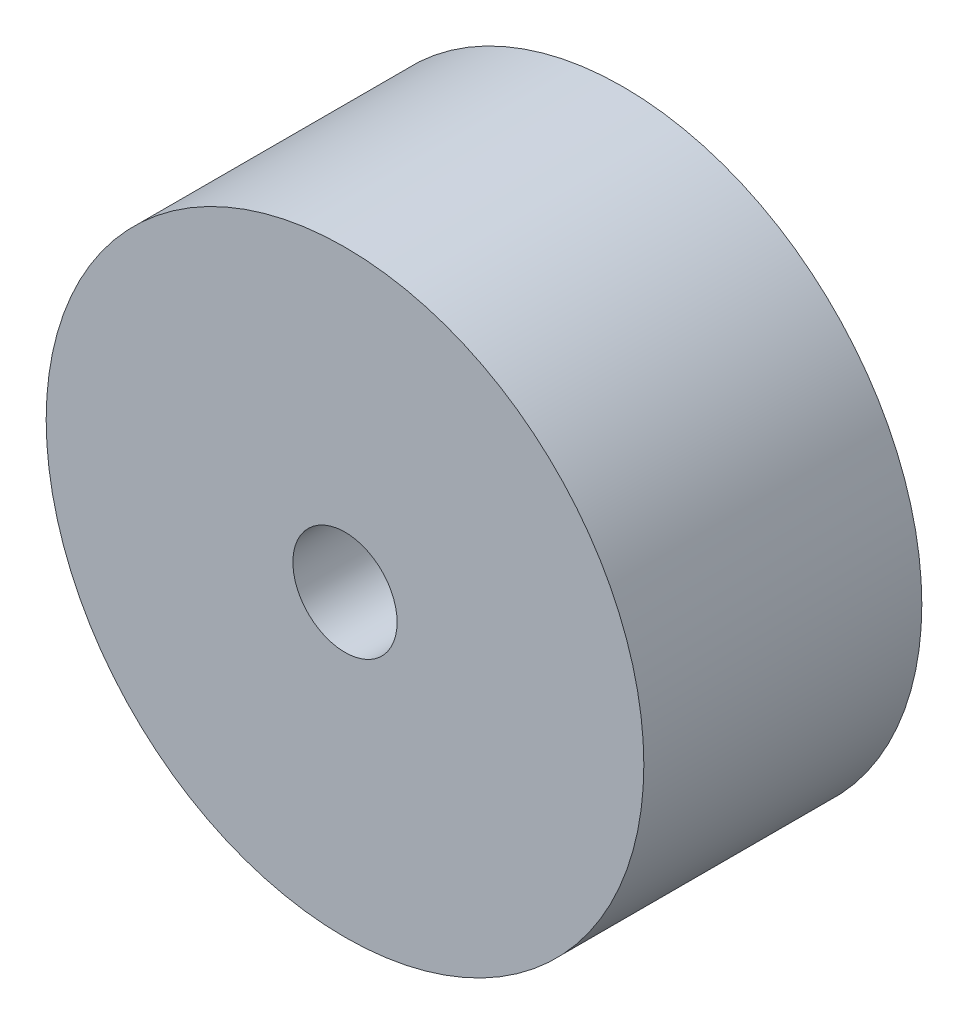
ISO-10303-21;
HEADER;
FILE_DESCRIPTION(('STEP AP214'),'2;1');
FILE_NAME('part.step','',(''),(''),'','','');
FILE_SCHEMA(('AUTOMOTIVE_DESIGN { 1 0 10303 214 1 1 1 1 }'));
ENDSEC;
DATA;
#1=APPLICATION_CONTEXT('core data for automotive mechanical design processes');
#2=APPLICATION_PROTOCOL_DEFINITION('international standard','automotive_design',2000,#1);
#3=PRODUCT_CONTEXT('',#1,'mechanical');
#4=PRODUCT('Part','Part','',(#3));
#5=PRODUCT_RELATED_PRODUCT_CATEGORY('part','',(#4));
#6=PRODUCT_DEFINITION_FORMATION('','',#4);
#7=PRODUCT_DEFINITION_CONTEXT('part definition',#1,'design');
#8=PRODUCT_DEFINITION('design','',#6,#7);
#9=PRODUCT_DEFINITION_SHAPE('','',#8);
#10=(LENGTH_UNIT() NAMED_UNIT(*) SI_UNIT(.MILLI.,.METRE.));
#11=(NAMED_UNIT(*) PLANE_ANGLE_UNIT() SI_UNIT($,.RADIAN.));
#12=(NAMED_UNIT(*) SI_UNIT($,.STERADIAN.) SOLID_ANGLE_UNIT());
#13=UNCERTAINTY_MEASURE_WITH_UNIT(LENGTH_MEASURE(1.E-05),#10,'distance_accuracy_value','');
#14=(GEOMETRIC_REPRESENTATION_CONTEXT(3) GLOBAL_UNCERTAINTY_ASSIGNED_CONTEXT((#13)) GLOBAL_UNIT_ASSIGNED_CONTEXT((#10,
#11,#12)) REPRESENTATION_CONTEXT('',''));
#15=CARTESIAN_POINT('',(0.,0.,0.));
#16=DIRECTION('',(0.,0.,1.));
#17=DIRECTION('',(1.,0.,0.));
#18=AXIS2_PLACEMENT_3D('',#15,#16,#17);
#19=CARTESIAN_POINT('',(0.,0.,40.));
#20=DIRECTION('',(0.,0.,1.));
#21=DIRECTION('',(1.,0.,0.));
#22=AXIS2_PLACEMENT_3D('',#19,#20,#21);
#23=PLANE('',#22);
#24=CARTESIAN_POINT('',(0.,0.,40.));
#25=DIRECTION('',(0.,0.,1.));
#26=DIRECTION('',(1.,0.,0.));
#27=AXIS2_PLACEMENT_3D('',#24,#25,#26);
#28=CIRCLE('',#27,43.);
#29=CARTESIAN_POINT('',(43.,0.,40.));
#30=VERTEX_POINT('',#29);
#31=EDGE_CURVE('E10',#30,#30,#28,.T.);
#32=ORIENTED_EDGE('',*,*,#31,.T.);
#33=EDGE_LOOP('',(#32));
#34=FACE_BOUND('',#33,.T.);
#35=CARTESIAN_POINT('',(0.,0.,40.));
#36=DIRECTION('',(0.,0.,1.));
#37=DIRECTION('',(1.,0.,0.));
#38=AXIS2_PLACEMENT_3D('',#35,#36,#37);
#39=CIRCLE('',#38,7.5);
#40=CARTESIAN_POINT('',(7.5,0.,40.));
#41=VERTEX_POINT('',#40);
#42=EDGE_CURVE('E40',#41,#41,#39,.T.);
#43=ORIENTED_EDGE('',*,*,#42,.F.);
#44=EDGE_LOOP('',(#43));
#45=FACE_BOUND('',#44,.T.);
#46=ADVANCED_FACE('F29',(#34,#45),#23,.T.);
#47=CARTESIAN_POINT('',(0.,0.,0.));
#48=DIRECTION('',(0.,0.,1.));
#49=DIRECTION('',(1.,0.,0.));
#50=AXIS2_PLACEMENT_3D('',#47,#48,#49);
#51=PLANE('',#50);
#52=CARTESIAN_POINT('',(0.,0.,0.));
#53=DIRECTION('',(0.,0.,1.));
#54=DIRECTION('',(1.,0.,0.));
#55=AXIS2_PLACEMENT_3D('',#52,#53,#54);
#56=CIRCLE('',#55,43.);
#57=CARTESIAN_POINT('',(43.,0.,0.));
#58=VERTEX_POINT('',#57);
#59=EDGE_CURVE('E33',#58,#58,#56,.T.);
#60=ORIENTED_EDGE('',*,*,#59,.F.);
#61=EDGE_LOOP('',(#60));
#62=FACE_BOUND('',#61,.T.);
#63=CARTESIAN_POINT('',(0.,0.,0.));
#64=DIRECTION('',(0.,0.,1.));
#65=DIRECTION('',(1.,0.,0.));
#66=AXIS2_PLACEMENT_3D('',#63,#64,#65);
#67=CIRCLE('',#66,7.5);
#68=CARTESIAN_POINT('',(7.5,0.,0.));
#69=VERTEX_POINT('',#68);
#70=EDGE_CURVE('E42',#69,#69,#67,.T.);
#71=ORIENTED_EDGE('',*,*,#70,.T.);
#72=EDGE_LOOP('',(#71));
#73=FACE_BOUND('',#72,.T.);
#74=ADVANCED_FACE('F52',(#62,#73),#51,.F.);
#75=CARTESIAN_POINT('',(0.,0.,40.));
#76=DIRECTION('',(0.,0.,-1.));
#77=DIRECTION('',(-1.,0.,0.));
#78=AXIS2_PLACEMENT_3D('',#75,#76,#77);
#79=CYLINDRICAL_SURFACE('',#78,43.);
#80=ORIENTED_EDGE('',*,*,#31,.F.);
#81=EDGE_LOOP('',(#80));
#82=FACE_BOUND('',#81,.T.);
#83=ORIENTED_EDGE('',*,*,#59,.T.);
#84=EDGE_LOOP('',(#83));
#85=FACE_BOUND('',#84,.T.);
#86=ADVANCED_FACE('F31',(#82,#85),#79,.T.);
#87=CARTESIAN_POINT('',(0.,0.,40.));
#88=DIRECTION('',(0.,0.,-1.));
#89=DIRECTION('',(-1.,0.,0.));
#90=AXIS2_PLACEMENT_3D('',#87,#88,#89);
#91=CYLINDRICAL_SURFACE('',#90,7.5);
#92=ORIENTED_EDGE('',*,*,#42,.T.);
#93=EDGE_LOOP('',(#92));
#94=FACE_BOUND('',#93,.T.);
#95=ORIENTED_EDGE('',*,*,#70,.F.);
#96=EDGE_LOOP('',(#95));
#97=FACE_BOUND('',#96,.T.);
#98=ADVANCED_FACE('F48',(#94,#97),#91,.F.);
#99=CLOSED_SHELL('',(#46,#74,#86,#98));
#100=MANIFOLD_SOLID_BREP('B2',#99);
#101=ADVANCED_BREP_SHAPE_REPRESENTATION('',(#18,#100),#14);
#102=SHAPE_DEFINITION_REPRESENTATION(#9,#101);
ENDSEC;
END-ISO-10303-21;
